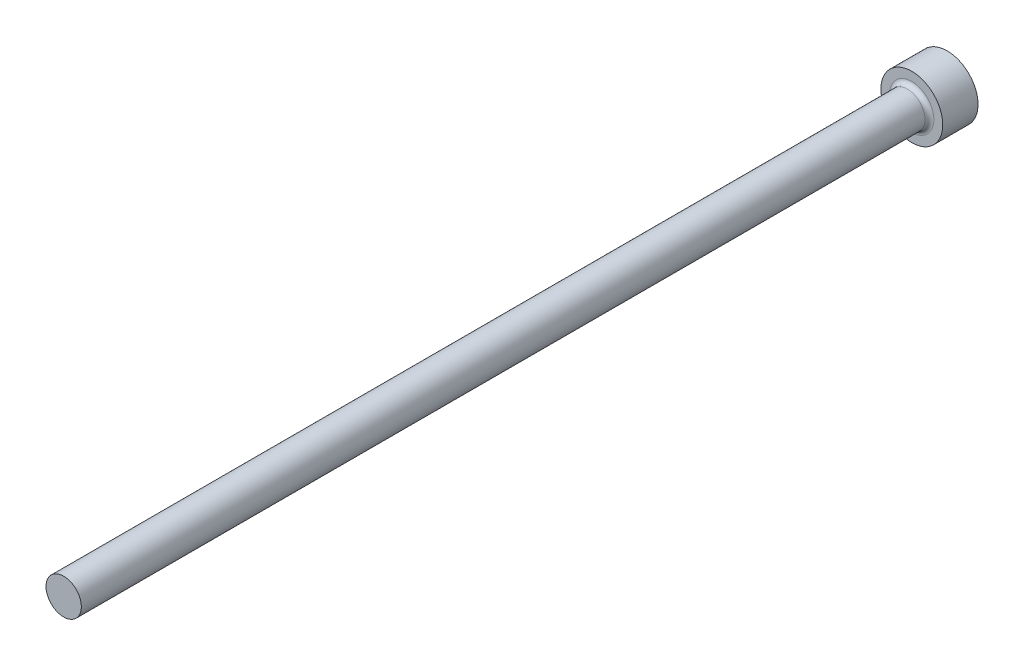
ISO-10303-21;
HEADER;
FILE_DESCRIPTION(('STEP AP214'),'2;1');
FILE_NAME('part.step','',(''),(''),'','','');
FILE_SCHEMA(('AUTOMOTIVE_DESIGN { 1 0 10303 214 1 1 1 1 }'));
ENDSEC;
DATA;
#1=APPLICATION_CONTEXT('core data for automotive mechanical design processes');
#2=APPLICATION_PROTOCOL_DEFINITION('international standard','automotive_design',2000,#1);
#3=PRODUCT_CONTEXT('',#1,'mechanical');
#4=PRODUCT('Part','Part','',(#3));
#5=PRODUCT_RELATED_PRODUCT_CATEGORY('part','',(#4));
#6=PRODUCT_DEFINITION_FORMATION('','',#4);
#7=PRODUCT_DEFINITION_CONTEXT('part definition',#1,'design');
#8=PRODUCT_DEFINITION('design','',#6,#7);
#9=PRODUCT_DEFINITION_SHAPE('','',#8);
#10=(LENGTH_UNIT() NAMED_UNIT(*) SI_UNIT(.MILLI.,.METRE.));
#11=(NAMED_UNIT(*) PLANE_ANGLE_UNIT() SI_UNIT($,.RADIAN.));
#12=(NAMED_UNIT(*) SI_UNIT($,.STERADIAN.) SOLID_ANGLE_UNIT());
#13=UNCERTAINTY_MEASURE_WITH_UNIT(LENGTH_MEASURE(1.E-05),#10,'distance_accuracy_value','');
#14=(GEOMETRIC_REPRESENTATION_CONTEXT(3) GLOBAL_UNCERTAINTY_ASSIGNED_CONTEXT((#13)) GLOBAL_UNIT_ASSIGNED_CONTEXT((#10,
#11,#12)) REPRESENTATION_CONTEXT('',''));
#15=CARTESIAN_POINT('',(0.,0.,0.));
#16=DIRECTION('',(0.,0.,1.));
#17=DIRECTION('',(1.,0.,0.));
#18=AXIS2_PLACEMENT_3D('',#15,#16,#17);
#19=CARTESIAN_POINT('',(3.5,0.,4.));
#20=DIRECTION('',(0.,0.,-1.));
#21=DIRECTION('',(-1.,0.,0.));
#22=AXIS2_PLACEMENT_3D('',#19,#20,#21);
#23=PLANE('',#22);
#24=CARTESIAN_POINT('',(0.,0.,4.));
#25=DIRECTION('',(0.,0.,-1.));
#26=DIRECTION('',(-1.,0.,0.));
#27=AXIS2_PLACEMENT_3D('',#24,#25,#26);
#28=CIRCLE('',#27,2.50000000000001);
#29=CARTESIAN_POINT('',(-2.50000000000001,0.,4.));
#30=VERTEX_POINT('',#29);
#31=EDGE_CURVE('E40',#30,#30,#28,.T.);
#32=ORIENTED_EDGE('',*,*,#31,.T.);
#33=EDGE_LOOP('',(#32));
#34=FACE_BOUND('',#33,.T.);
#35=CARTESIAN_POINT('',(0.,0.,4.));
#36=DIRECTION('',(0.,0.,-1.));
#37=DIRECTION('',(-1.,0.,0.));
#38=AXIS2_PLACEMENT_3D('',#35,#36,#37);
#39=CIRCLE('',#38,3.5);
#40=CARTESIAN_POINT('',(-3.5,0.,4.));
#41=VERTEX_POINT('',#40);
#42=EDGE_CURVE('E44',#41,#41,#39,.T.);
#43=ORIENTED_EDGE('',*,*,#42,.F.);
#44=EDGE_LOOP('',(#43));
#45=FACE_BOUND('',#44,.T.);
#46=ADVANCED_FACE('F33',(#34,#45),#23,.F.);
#47=CARTESIAN_POINT('',(0.,0.,-9.03322817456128));
#48=DIRECTION('',(0.,0.,-1.));
#49=DIRECTION('',(-1.,0.,0.));
#50=AXIS2_PLACEMENT_3D('',#47,#48,#49);
#51=CYLINDRICAL_SURFACE('',#50,3.5);
#52=CARTESIAN_POINT('',(0.,0.,0.));
#53=DIRECTION('',(0.,0.,-1.));
#54=DIRECTION('',(-1.,0.,0.));
#55=AXIS2_PLACEMENT_3D('',#52,#53,#54);
#56=CIRCLE('',#55,3.5);
#57=CARTESIAN_POINT('',(-3.5,0.,0.));
#58=VERTEX_POINT('',#57);
#59=EDGE_CURVE('E48',#58,#58,#56,.T.);
#60=ORIENTED_EDGE('',*,*,#59,.F.);
#61=EDGE_LOOP('',(#60));
#62=FACE_BOUND('',#61,.T.);
#63=ORIENTED_EDGE('',*,*,#42,.T.);
#64=EDGE_LOOP('',(#63));
#65=FACE_BOUND('',#64,.T.);
#66=ADVANCED_FACE('F68',(#62,#65),#51,.T.);
#67=CARTESIAN_POINT('',(0.,0.,0.));
#68=DIRECTION('',(0.,0.,1.));
#69=DIRECTION('',(1.,0.,0.));
#70=AXIS2_PLACEMENT_3D('',#67,#68,#69);
#71=PLANE('',#70);
#72=ORIENTED_EDGE('',*,*,#59,.T.);
#73=EDGE_LOOP('',(#72));
#74=FACE_BOUND('',#73,.T.);
#75=ADVANCED_FACE('F61',(#74),#71,.F.);
#76=CARTESIAN_POINT('',(0.,0.,100.));
#77=DIRECTION('',(0.,0.,-1.));
#78=DIRECTION('',(-1.,0.,0.));
#79=AXIS2_PLACEMENT_3D('',#76,#77,#78);
#80=PLANE('',#79);
#81=CARTESIAN_POINT('',(0.,0.,100.));
#82=DIRECTION('',(0.,0.,-1.));
#83=DIRECTION('',(-1.,0.,0.));
#84=AXIS2_PLACEMENT_3D('',#81,#82,#83);
#85=CIRCLE('',#84,2.00000000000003);
#86=CARTESIAN_POINT('',(-2.00000000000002,0.,100.));
#87=VERTEX_POINT('',#86);
#88=EDGE_CURVE('E53',#87,#87,#85,.T.);
#89=ORIENTED_EDGE('',*,*,#88,.F.);
#90=EDGE_LOOP('',(#89));
#91=FACE_BOUND('',#90,.T.);
#92=ADVANCED_FACE('F59',(#91),#80,.F.);
#93=CARTESIAN_POINT('',(0.,0.,-9.03322817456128));
#94=DIRECTION('',(0.,0.,-1.));
#95=DIRECTION('',(-1.,0.,0.));
#96=AXIS2_PLACEMENT_3D('',#93,#94,#95);
#97=CYLINDRICAL_SURFACE('',#96,2.00000000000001);
#98=CARTESIAN_POINT('',(0.,0.,4.5));
#99=DIRECTION('',(0.,0.,-1.));
#100=DIRECTION('',(-1.,0.,0.));
#101=AXIS2_PLACEMENT_3D('',#98,#99,#100);
#102=CIRCLE('',#101,2.00000000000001);
#103=CARTESIAN_POINT('',(-2.00000000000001,0.,4.5));
#104=VERTEX_POINT('',#103);
#105=EDGE_CURVE('E10',#104,#104,#102,.F.);
#106=ORIENTED_EDGE('',*,*,#105,.T.);
#107=EDGE_LOOP('',(#106));
#108=FACE_BOUND('',#107,.T.);
#109=ORIENTED_EDGE('',*,*,#88,.T.);
#110=EDGE_LOOP('',(#109));
#111=FACE_BOUND('',#110,.T.);
#112=ADVANCED_FACE('F57',(#108,#111),#97,.T.);
#113=CARTESIAN_POINT('',(0.,0.,4.5));
#114=DIRECTION('',(0.,0.,-1.));
#115=DIRECTION('',(-1.,0.,0.));
#116=AXIS2_PLACEMENT_3D('',#113,#114,#115);
#117=TOROIDAL_SURFACE('',#116,2.50000000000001,0.5);
#118=ORIENTED_EDGE('',*,*,#105,.F.);
#119=EDGE_LOOP('',(#118));
#120=FACE_BOUND('',#119,.T.);
#121=ORIENTED_EDGE('',*,*,#31,.F.);
#122=EDGE_LOOP('',(#121));
#123=FACE_BOUND('',#122,.T.);
#124=ADVANCED_FACE('F35',(#120,#123),#117,.F.);
#125=CLOSED_SHELL('',(#46,#66,#75,#92,#112,#124));
#126=MANIFOLD_SOLID_BREP('B2',#125);
#127=ADVANCED_BREP_SHAPE_REPRESENTATION('',(#18,#126),#14);
#128=SHAPE_DEFINITION_REPRESENTATION(#9,#127);
ENDSEC;
END-ISO-10303-21;
